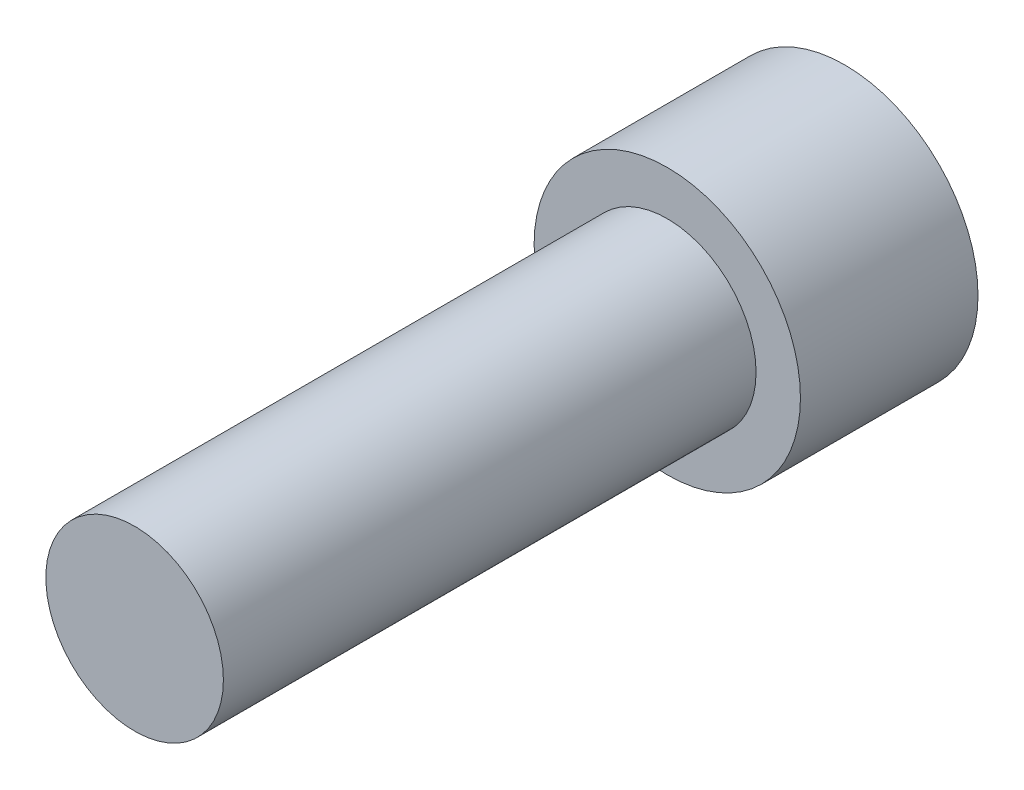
from build123d import *

# Parameters (mm, degrees)
HEX_2_DEPTH = 7.112


with BuildPart() as part:
    # Sketch6 → Revolve1 (revolve)
    with BuildSketch(Plane(origin=(0, 0, 0), x_dir=(0, 0, -1), z_dir=(1, 0, 0)), mode=Mode.PRIVATE) as revolve1_sk:
        Polygon((-38.1, 0), (-38.1, -6.35), (0, -6.35), (0, -9.525), (12.7, -9.525), (12.7, 0), align=None)
    revolve(revolve1_sk.sketch.rotate(Axis((0, 0, 38.1), (0, 0, -1)), 270), axis=Axis((0, 0, 38.1), (0, 0, -1)))

    # Sketch7 → HEX 2 (cut)
    with BuildSketch(Plane(origin=(0, 0, -12.7), x_dir=(-1, 0, 0), z_dir=(0, 0, -1))):
        Polygon((-4.7625, 2.749630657), (-4.7625, -2.749630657), (0, -5.499261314), (4.7625, -2.749630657), (4.7625, 2.749630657), (0, 5.499261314), align=None)
    extrude(amount=-HEX_2_DEPTH, mode=Mode.SUBTRACT)


solid = part.part
